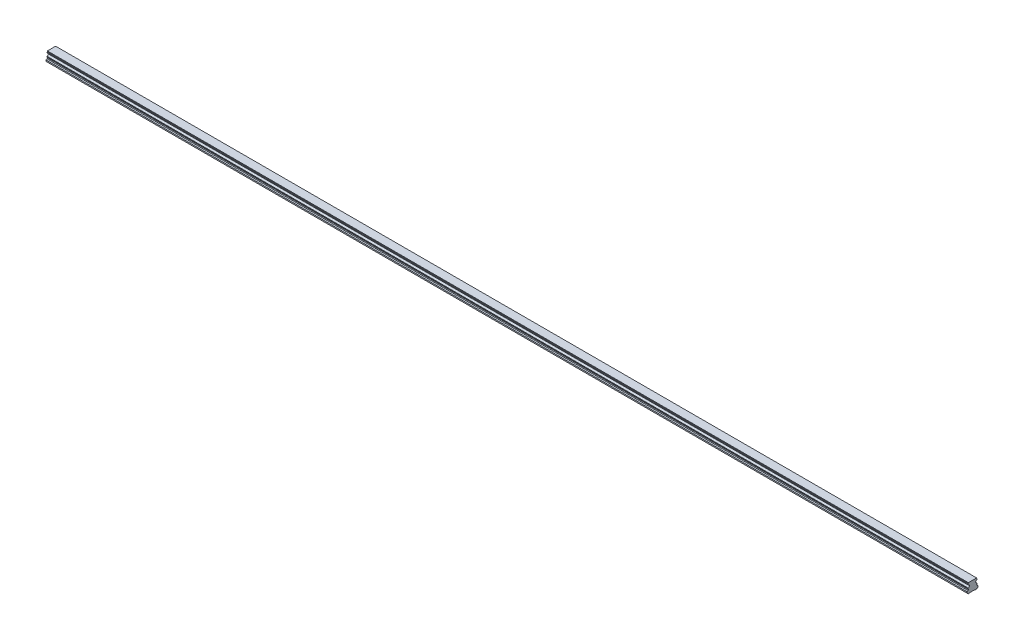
from build123d import *

# Parameters (mm, degrees)
BOSS_EXTRUDE1_DEPTH        = 2100
SKETCH3_R                  = 3
SKETCH3_R_2                = 2.5
CUT_EXTRUDE3_DEPTH         = 12
SKETCH3_2_R                = 2.5
CUT_EXTRUDE4_DEPTH         = 15
CHAMFER1_SIZE              = 0.5
LPATTERN4_COUNT            = 35
LPATTERN4_PITCH            = 60
CHAMFER1_OF_LPATTERN4_SIZE = 0.5


with BuildPart() as part:
    # Sketch1 → Boss-Extrude1 (new body)
    with BuildSketch(Plane(origin=(0, 0, 0), x_dir=(0, 0, -1), z_dir=(1, 0, 0))):
        with BuildLine():
            Line((9.375, 21.8), (-9.375, 21.8))
            Line((-9.375, 21.8), (-9.375, 20.756))
            Line((-9.375, 20.756), (-10, 19.415683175))
            Line((-10, 19.415683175), (-10, 17.685449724))
            ThreePointArc((-10, 17.685449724), (-7.2, 14.6), (-10, 11.514550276))
            Line((-10, 11.514550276), (-10, 9.784316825))
            Line((-10, 9.784316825), (-9.375, 8.444))
            Line((-9.375, 8.444), (-9.922688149, 6.4))
            Line((-9.922688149, 6.4), (-12.5, 5.489338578))
            Line((-12.5, 5.489338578), (-12.5, 2.65))
            Line((-12.5, 2.65), (-9.85, 0))
            Line((-9.85, 0), (-5.5, 0))
            Line((-5.5, 0), (-5, 0.5))
            Line((-5, 0.5), (5, 0.5))
            Line((5, 0.5), (5.5, 0))
            Line((5.5, 0), (9.85, 0))
            Line((9.85, 0), (12.5, 2.65))
            Line((12.5, 2.65), (12.5, 5.489338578))
            Line((12.5, 5.489338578), (9.922688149, 6.4))
            Line((9.922688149, 6.4), (9.375, 8.444))
            Line((9.375, 8.444), (10, 9.784316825))
            Line((10, 9.784316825), (10, 11.514550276))
            ThreePointArc((10, 11.514550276), (7.2, 14.6), (10, 17.685449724))
            Line((10, 17.685449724), (10, 19.415683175))
            Line((10, 19.415683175), (9.375, 20.756))
            Line((9.375, 20.756), (9.375, 21.8))
        make_face()
    extrude(amount=BOSS_EXTRUDE1_DEPTH)

    # Sketch3 → Cut-Extrude3 (cut)
    with BuildSketch(Plane.XZ):
        with Locations(Location((30, 0, 0), (0, 0, 270))):
            Circle(SKETCH3_R)
        with Locations(Location((30, 0, 0), (0, 0, 270))):
            Circle(SKETCH3_R_2, mode=Mode.SUBTRACT)
    cut_extrude3 = extrude(amount=-CUT_EXTRUDE3_DEPTH, mode=Mode.SUBTRACT)

    # Sketch3_2 → Cut-Extrude4 (cut)
    with BuildSketch(Plane.XZ):
        with Locations(Location((30, 0, 0), (0, 0, 270))):
            Circle(SKETCH3_2_R)
    cut_extrude4 = extrude(amount=-CUT_EXTRUDE4_DEPTH, mode=Mode.SUBTRACT)

    # Cut-Extrude5 cone 1 section (on through the dimple's axis) → Cut-Extrude5 (revolve, cut)
    with BuildSketch(Plane(origin=(30, 15, 0), x_dir=(0, 0, -1), z_dir=(1, 0, 0))):
        Polygon((0, 0), (2.5, 0), (0, 1.443375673), align=None)
    cut_extrude5 = revolve(axis=Axis((30, 15, 0), (0, 1, 0)), mode=Mode.SUBTRACT)

    # Chamfer1
    chamfer1_edges = [part.edges().sort_by_distance(p)[0] for p in [
        (30, 0.5, 3),
    ]]
    chamfer(chamfer1_edges, length=CHAMFER1_SIZE)

    # LPattern4: Cut-Extrude3, Cut-Extrude4, Cut-Extrude5 ×35
    with Locations(*[(i * LPATTERN4_PITCH, 0, 0) for i in range(1, LPATTERN4_COUNT)]):
        add(cut_extrude3, mode=Mode.SUBTRACT)
        add(cut_extrude4, mode=Mode.SUBTRACT)
        add(cut_extrude5, mode=Mode.SUBTRACT)

    # Chamfer1 of LPattern4
    chamfer1_of_lpattern4_edges = [part.edges().sort_by_distance(p)[0] for p in [
        (90, 0.5, 3),
        (150, 0.5, 3),
        (210, 0.5, 3),
        (270, 0.5, 3),
        (330, 0.5, 3),
        (390, 0.5, 3),
        (450, 0.5, 3),
        (510, 0.5, 3),
        (570, 0.5, 3),
        (630, 0.5, 3),
        (690, 0.5, 3),
        (750, 0.5, 3),
        (810, 0.5, 3),
        (870, 0.5, 3),
        (930, 0.5, 3),
        (990, 0.5, 3),
        (1050, 0.5, 3),
        (1110, 0.5, 3),
        (1170, 0.5, 3),
        (1230, 0.5, 3),
        (1290, 0.5, 3),
        (1350, 0.5, 3),
        (1410, 0.5, 3),
        (1470, 0.5, 3),
        (1530, 0.5, 3),
        (1590, 0.5, 3),
        (1650, 0.5, 3),
        (1710, 0.5, 3),
        (1770, 0.5, 3),
        (1830, 0.5, 3),
        (1890, 0.5, 3),
        (1950, 0.5, 3),
        (2010, 0.5, 3),
        (2070, 0.5, 3),
    ]]
    chamfer(chamfer1_of_lpattern4_edges, length=CHAMFER1_OF_LPATTERN4_SIZE)


solid = part.part
